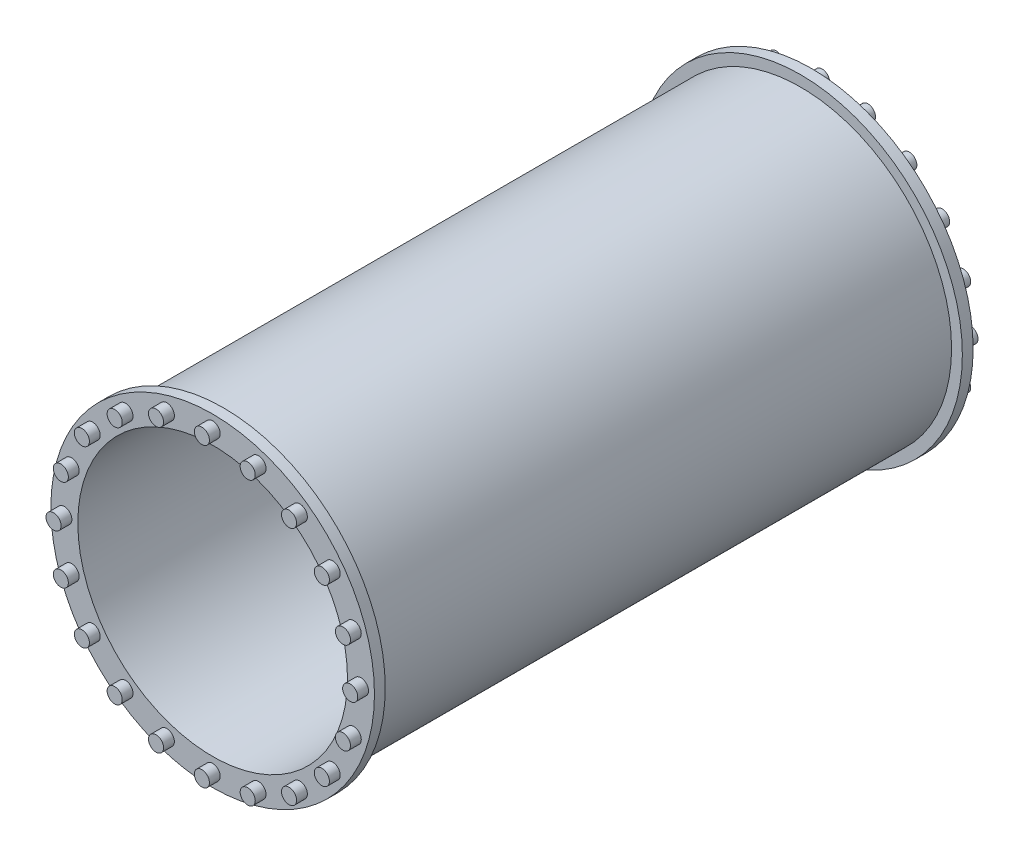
from build123d import *
from build123d.topology import SkipClean

# Parameters (mm, degrees)
SKETCH1_R           = 150
SKETCH1_R_2         = 125
BOSS_EXTRUDE1_DEPTH = 10
SKETCH2_R           = 7
BOSS_EXTRUDE2_DEPTH = 10
CIRPATTERN1_COUNT   = 20
BOSS_EXTRUDE3_START = 535
SKETCH3_R           = 140
SKETCH3_R_2         = 125
BOSS_EXTRUDE3_DEPTH = 535
BOSS_EXTRUDE4_START = 10
SKETCH4_R           = 150
SKETCH4_R_2         = 125
BOSS_EXTRUDE4_DEPTH = 10
BOSS_EXTRUDE5_START = 10
SKETCH5_R           = 7
BOSS_EXTRUDE5_DEPTH = 10
CIRPATTERN2_COUNT   = 20


with BuildPart() as part:
    # Sketch1 → Boss-Extrude1 (new body)
    with BuildSketch(Plane.XY):
        Circle(SKETCH1_R)
        Circle(SKETCH1_R_2, mode=Mode.SUBTRACT)
    extrude(amount=BOSS_EXTRUDE1_DEPTH)

    # Sketch2 → Boss-Extrude2 (add)
    with BuildSketch(Plane.XY.offset(10)):
        with Locations((0, 137.5)):
            Circle(SKETCH2_R)
    boss_extrude2 = extrude(amount=BOSS_EXTRUDE2_DEPTH)

    # CirPattern1: Boss-Extrude2 ×20 about axis
    cirpattern1_axis = Axis((0, 0, 0), (0, 0, 1))
    for i in range(1, CIRPATTERN1_COUNT):
        add(boss_extrude2.rotate(cirpattern1_axis, i * 360 / CIRPATTERN1_COUNT))

    # Sketch3 → Boss-Extrude3 (add)
    with SkipClean():  # the faces are left unmerged after this step: merging them gives an invalid solid
        with BuildSketch(Plane(origin=(0, 0, 0), x_dir=(-1, 0, 0), z_dir=(0, 0, -1)).offset(BOSS_EXTRUDE3_START)):
            Circle(SKETCH3_R)
            Circle(SKETCH3_R_2, mode=Mode.SUBTRACT)
        extrude(amount=-BOSS_EXTRUDE3_DEPTH)

    # Sketch4 → Boss-Extrude4 (add)
    with SkipClean():  # the faces are left unmerged after this step: merging them gives an invalid solid
        with BuildSketch(Plane(origin=(0, 0, -535), x_dir=(-1, 0, 0), z_dir=(0, 0, -1)).offset(BOSS_EXTRUDE4_START)):
            with Locations(Location((0, 0, 0), (0, 0, 180))):
                Circle(SKETCH4_R)
            Circle(SKETCH4_R_2, mode=Mode.SUBTRACT)
        extrude(amount=-BOSS_EXTRUDE4_DEPTH)

    # Sketch5 → Boss-Extrude5 (add)
    with SkipClean():  # the faces are left unmerged after this step: merging them gives an invalid solid
        with BuildSketch(Plane(origin=(0, 0, -545), x_dir=(-1, 0, 0), z_dir=(0, 0, -1)).offset(BOSS_EXTRUDE5_START)):
            with Locations(Location((0, 137.5, 0), (0, 0, 180))):
                Circle(SKETCH5_R)
        boss_extrude5 = extrude(amount=-BOSS_EXTRUDE5_DEPTH)

    # CirPattern2: Boss-Extrude5 ×20 about axis
    with SkipClean():  # the faces are left unmerged after this step: merging them gives an invalid solid
        cirpattern2_axis = Axis((0, 0, 0), (0, 0, 1))
        for i in range(1, CIRPATTERN2_COUNT):
            add(boss_extrude5.rotate(cirpattern2_axis, i * 360 / CIRPATTERN2_COUNT))


solid = part.part
